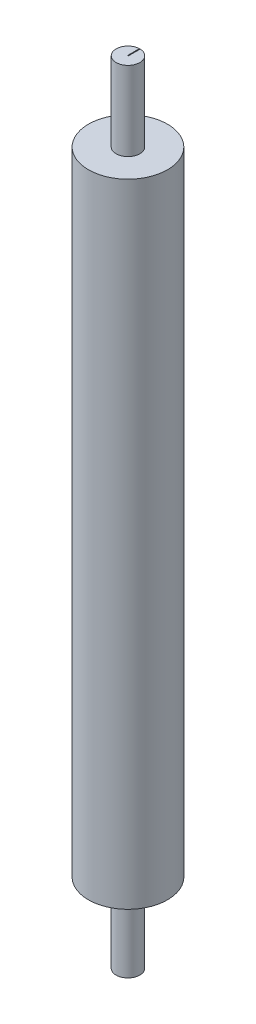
ISO-10303-21;
HEADER;
FILE_DESCRIPTION(('STEP AP214'),'2;1');
FILE_NAME('part.step','',(''),(''),'','','');
FILE_SCHEMA(('AUTOMOTIVE_DESIGN { 1 0 10303 214 1 1 1 1 }'));
ENDSEC;
DATA;
#1=APPLICATION_CONTEXT('core data for automotive mechanical design processes');
#2=APPLICATION_PROTOCOL_DEFINITION('international standard','automotive_design',2000,#1);
#3=PRODUCT_CONTEXT('',#1,'mechanical');
#4=PRODUCT('Part','Part','',(#3));
#5=PRODUCT_RELATED_PRODUCT_CATEGORY('part','',(#4));
#6=PRODUCT_DEFINITION_FORMATION('','',#4);
#7=PRODUCT_DEFINITION_CONTEXT('part definition',#1,'design');
#8=PRODUCT_DEFINITION('design','',#6,#7);
#9=PRODUCT_DEFINITION_SHAPE('','',#8);
#10=(LENGTH_UNIT() NAMED_UNIT(*) SI_UNIT(.MILLI.,.METRE.));
#11=(NAMED_UNIT(*) PLANE_ANGLE_UNIT() SI_UNIT($,.RADIAN.));
#12=(NAMED_UNIT(*) SI_UNIT($,.STERADIAN.) SOLID_ANGLE_UNIT());
#13=UNCERTAINTY_MEASURE_WITH_UNIT(LENGTH_MEASURE(1.E-05),#10,'distance_accuracy_value','');
#14=(GEOMETRIC_REPRESENTATION_CONTEXT(3) GLOBAL_UNCERTAINTY_ASSIGNED_CONTEXT((#13)) GLOBAL_UNIT_ASSIGNED_CONTEXT((#10,
#11,#12)) REPRESENTATION_CONTEXT('',''));
#15=CARTESIAN_POINT('',(0.,0.,0.));
#16=DIRECTION('',(0.,0.,1.));
#17=DIRECTION('',(1.,0.,0.));
#18=AXIS2_PLACEMENT_3D('',#15,#16,#17);
#19=CARTESIAN_POINT('',(0.,400.,0.));
#20=DIRECTION('',(0.,-1.,0.));
#21=DIRECTION('',(0.,0.,-1.));
#22=AXIS2_PLACEMENT_3D('',#19,#20,#21);
#23=CYLINDRICAL_SURFACE('',#22,25.);
#24=CARTESIAN_POINT('',(0.,400.,0.));
#25=DIRECTION('',(0.,1.,0.));
#26=DIRECTION('',(0.,0.,1.));
#27=AXIS2_PLACEMENT_3D('',#24,#25,#26);
#28=CIRCLE('',#27,25.);
#29=CARTESIAN_POINT('',(0.,400.,25.));
#30=VERTEX_POINT('',#29);
#31=EDGE_CURVE('E111',#30,#30,#28,.T.);
#32=ORIENTED_EDGE('',*,*,#31,.F.);
#33=EDGE_LOOP('',(#32));
#34=FACE_BOUND('',#33,.T.);
#35=CARTESIAN_POINT('',(0.,0.,0.));
#36=DIRECTION('',(0.,1.,0.));
#37=DIRECTION('',(0.,0.,1.));
#38=AXIS2_PLACEMENT_3D('',#35,#36,#37);
#39=CIRCLE('',#38,25.);
#40=CARTESIAN_POINT('',(0.,0.,25.));
#41=VERTEX_POINT('',#40);
#42=EDGE_CURVE('E117',#41,#41,#39,.T.);
#43=ORIENTED_EDGE('',*,*,#42,.T.);
#44=EDGE_LOOP('',(#43));
#45=FACE_BOUND('',#44,.T.);
#46=ADVANCED_FACE('F36',(#34,#45),#23,.T.);
#47=CARTESIAN_POINT('',(0.,400.,0.));
#48=DIRECTION('',(0.,1.,0.));
#49=DIRECTION('',(0.,0.,1.));
#50=AXIS2_PLACEMENT_3D('',#47,#48,#49);
#51=PLANE('',#50);
#52=CARTESIAN_POINT('',(0.,400.,0.));
#53=DIRECTION('',(0.,1.,0.));
#54=DIRECTION('',(0.,0.,1.));
#55=AXIS2_PLACEMENT_3D('',#52,#53,#54);
#56=CIRCLE('',#55,7.5);
#57=CARTESIAN_POINT('',(0.,400.,7.5));
#58=VERTEX_POINT('',#57);
#59=EDGE_CURVE('E43',#58,#58,#56,.T.);
#60=ORIENTED_EDGE('',*,*,#59,.F.);
#61=EDGE_LOOP('',(#60));
#62=FACE_BOUND('',#61,.T.);
#63=ORIENTED_EDGE('',*,*,#31,.T.);
#64=EDGE_LOOP('',(#63));
#65=FACE_BOUND('',#64,.T.);
#66=ADVANCED_FACE('F126',(#62,#65),#51,.T.);
#67=CARTESIAN_POINT('',(0.,0.,0.));
#68=DIRECTION('',(0.,1.,0.));
#69=DIRECTION('',(0.,0.,1.));
#70=AXIS2_PLACEMENT_3D('',#67,#68,#69);
#71=PLANE('',#70);
#72=CARTESIAN_POINT('',(0.,0.,0.));
#73=DIRECTION('',(0.,1.,0.));
#74=DIRECTION('',(0.,0.,1.));
#75=AXIS2_PLACEMENT_3D('',#72,#73,#74);
#76=CIRCLE('',#75,7.5);
#77=CARTESIAN_POINT('',(0.,0.,7.5));
#78=VERTEX_POINT('',#77);
#79=EDGE_CURVE('E114',#78,#78,#76,.T.);
#80=ORIENTED_EDGE('',*,*,#79,.T.);
#81=EDGE_LOOP('',(#80));
#82=FACE_BOUND('',#81,.T.);
#83=ORIENTED_EDGE('',*,*,#42,.F.);
#84=EDGE_LOOP('',(#83));
#85=FACE_BOUND('',#84,.T.);
#86=ADVANCED_FACE('F123',(#82,#85),#71,.F.);
#87=CARTESIAN_POINT('',(0.,-40.,0.));
#88=DIRECTION('',(0.,1.,0.));
#89=DIRECTION('',(0.,0.,1.));
#90=AXIS2_PLACEMENT_3D('',#87,#88,#89);
#91=CYLINDRICAL_SURFACE('',#90,7.5);
#92=ORIENTED_EDGE('',*,*,#79,.F.);
#93=EDGE_LOOP('',(#92));
#94=FACE_BOUND('',#93,.T.);
#95=CARTESIAN_POINT('',(0.,-50.,0.));
#96=DIRECTION('',(0.,1.,0.));
#97=DIRECTION('',(0.,0.,1.));
#98=AXIS2_PLACEMENT_3D('',#95,#96,#97);
#99=CIRCLE('',#98,7.5);
#100=CARTESIAN_POINT('',(0.,-50.,7.5));
#101=VERTEX_POINT('',#100);
#102=EDGE_CURVE('E108',#101,#101,#99,.T.);
#103=ORIENTED_EDGE('',*,*,#102,.T.);
#104=EDGE_LOOP('',(#103));
#105=FACE_BOUND('',#104,.T.);
#106=ADVANCED_FACE('F125',(#94,#105),#91,.T.);
#107=CARTESIAN_POINT('',(0.,-50.,0.));
#108=DIRECTION('',(0.,1.,0.));
#109=DIRECTION('',(0.,0.,1.));
#110=AXIS2_PLACEMENT_3D('',#107,#108,#109);
#111=PLANE('',#110);
#112=ORIENTED_EDGE('',*,*,#102,.F.);
#113=EDGE_LOOP('',(#112));
#114=FACE_BOUND('',#113,.T.);
#115=ADVANCED_FACE('F132',(#114),#111,.F.);
#116=CARTESIAN_POINT('',(0.,450.,0.));
#117=DIRECTION('',(0.,-1.,0.));
#118=DIRECTION('',(0.,0.,-1.));
#119=AXIS2_PLACEMENT_3D('',#116,#117,#118);
#120=CYLINDRICAL_SURFACE('',#119,7.5);
#121=CARTESIAN_POINT('',(0.,449.5,0.));
#122=DIRECTION('',(0.,-1.,0.));
#123=DIRECTION('',(0.,0.,-1.));
#124=AXIS2_PLACEMENT_3D('',#121,#122,#123);
#125=CIRCLE('',#124,7.5);
#126=CARTESIAN_POINT('',(-0.25,449.5,-7.49583217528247));
#127=VERTEX_POINT('',#126);
#128=CARTESIAN_POINT('',(0.25,449.5,-7.49583217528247));
#129=VERTEX_POINT('',#128);
#130=EDGE_CURVE('E11',#127,#129,#125,.T.);
#131=ORIENTED_EDGE('',*,*,#130,.T.);
#132=DIRECTION('',(0.,-1.,0.));
#133=VECTOR('',#132,1.);
#134=CARTESIAN_POINT('',(0.25,450.,-7.49583217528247));
#135=LINE('',#134,#133);
#136=CARTESIAN_POINT('',(0.25,450.,-7.49583217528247));
#137=VERTEX_POINT('',#136);
#138=EDGE_CURVE('E103',#129,#137,#135,.F.);
#139=ORIENTED_EDGE('',*,*,#138,.T.);
#140=CARTESIAN_POINT('',(0.,450.,0.));
#141=DIRECTION('',(0.,1.,0.));
#142=DIRECTION('',(0.,0.,1.));
#143=AXIS2_PLACEMENT_3D('',#140,#141,#142);
#144=CIRCLE('',#143,7.5);
#145=CARTESIAN_POINT('',(-0.25,450.,-7.49583217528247));
#146=VERTEX_POINT('',#145);
#147=EDGE_CURVE('E105',#146,#137,#144,.T.);
#148=ORIENTED_EDGE('',*,*,#147,.F.);
#149=DIRECTION('',(0.,-1.,0.));
#150=VECTOR('',#149,1.);
#151=CARTESIAN_POINT('',(-0.25,450.,-7.49583217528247));
#152=LINE('',#151,#150);
#153=EDGE_CURVE('E50',#127,#146,#152,.F.);
#154=ORIENTED_EDGE('',*,*,#153,.F.);
#155=EDGE_LOOP('',(#131,#139,#148,#154));
#156=FACE_BOUND('',#155,.T.);
#157=ORIENTED_EDGE('',*,*,#59,.T.);
#158=EDGE_LOOP('',(#157));
#159=FACE_BOUND('',#158,.T.);
#160=ADVANCED_FACE('F163',(#156,#159),#120,.T.);
#161=CARTESIAN_POINT('',(0.,450.,0.));
#162=DIRECTION('',(0.,1.,0.));
#163=DIRECTION('',(0.,0.,1.));
#164=AXIS2_PLACEMENT_3D('',#161,#162,#163);
#165=PLANE('',#164);
#166=DIRECTION('',(0.,0.,-1.));
#167=VECTOR('',#166,1.);
#168=CARTESIAN_POINT('',(0.25,450.,0.));
#169=LINE('',#168,#167);
#170=CARTESIAN_POINT('',(0.25,450.,0.));
#171=VERTEX_POINT('',#170);
#172=EDGE_CURVE('E97',#171,#137,#169,.T.);
#173=ORIENTED_EDGE('',*,*,#172,.F.);
#174=DIRECTION('',(-1.,0.,0.));
#175=VECTOR('',#174,1.);
#176=CARTESIAN_POINT('',(0.25,450.,0.));
#177=LINE('',#176,#175);
#178=CARTESIAN_POINT('',(-0.25,450.,0.));
#179=VERTEX_POINT('',#178);
#180=EDGE_CURVE('E94',#171,#179,#177,.T.);
#181=ORIENTED_EDGE('',*,*,#180,.T.);
#182=DIRECTION('',(0.,0.,-1.));
#183=VECTOR('',#182,1.);
#184=CARTESIAN_POINT('',(-0.25,450.,0.));
#185=LINE('',#184,#183);
#186=EDGE_CURVE('E88',#179,#146,#185,.T.);
#187=ORIENTED_EDGE('',*,*,#186,.T.);
#188=ORIENTED_EDGE('',*,*,#147,.T.);
#189=EDGE_LOOP('',(#173,#181,#187,#188));
#190=FACE_BOUND('',#189,.T.);
#191=ADVANCED_FACE('F170',(#190),#165,.T.);
#192=CARTESIAN_POINT('',(0.,449.5,0.));
#193=DIRECTION('',(0.,-1.,0.));
#194=DIRECTION('',(-1.,0.,0.));
#195=AXIS2_PLACEMENT_3D('',#192,#193,#194);
#196=PLANE('',#195);
#197=ORIENTED_EDGE('',*,*,#130,.F.);
#198=DIRECTION('',(0.,0.,-1.));
#199=VECTOR('',#198,1.);
#200=CARTESIAN_POINT('',(-0.25,449.5,0.));
#201=LINE('',#200,#199);
#202=CARTESIAN_POINT('',(-0.25,449.5,0.));
#203=VERTEX_POINT('',#202);
#204=EDGE_CURVE('E85',#203,#127,#201,.T.);
#205=ORIENTED_EDGE('',*,*,#204,.F.);
#206=DIRECTION('',(-1.,0.,0.));
#207=VECTOR('',#206,1.);
#208=CARTESIAN_POINT('',(0.25,449.5,0.));
#209=LINE('',#208,#207);
#210=CARTESIAN_POINT('',(0.25,449.5,0.));
#211=VERTEX_POINT('',#210);
#212=EDGE_CURVE('E75',#211,#203,#209,.T.);
#213=ORIENTED_EDGE('',*,*,#212,.F.);
#214=DIRECTION('',(0.,0.,-1.));
#215=VECTOR('',#214,1.);
#216=CARTESIAN_POINT('',(0.25,449.5,0.));
#217=LINE('',#216,#215);
#218=EDGE_CURVE('E92',#211,#129,#217,.T.);
#219=ORIENTED_EDGE('',*,*,#218,.T.);
#220=EDGE_LOOP('',(#197,#205,#213,#219));
#221=FACE_BOUND('',#220,.T.);
#222=ADVANCED_FACE('F91',(#221),#196,.F.);
#223=CARTESIAN_POINT('',(0.25,449.5,0.));
#224=DIRECTION('',(1.,0.,0.));
#225=DIRECTION('',(0.,0.,-1.));
#226=AXIS2_PLACEMENT_3D('',#223,#224,#225);
#227=PLANE('',#226);
#228=ORIENTED_EDGE('',*,*,#218,.F.);
#229=DIRECTION('',(0.,1.,0.));
#230=VECTOR('',#229,1.);
#231=CARTESIAN_POINT('',(0.25,449.5,0.));
#232=LINE('',#231,#230);
#233=EDGE_CURVE('E80',#211,#171,#232,.T.);
#234=ORIENTED_EDGE('',*,*,#233,.T.);
#235=ORIENTED_EDGE('',*,*,#172,.T.);
#236=ORIENTED_EDGE('',*,*,#138,.F.);
#237=EDGE_LOOP('',(#228,#234,#235,#236));
#238=FACE_BOUND('',#237,.T.);
#239=ADVANCED_FACE('F182',(#238),#227,.F.);
#240=CARTESIAN_POINT('',(-0.25,449.5,0.));
#241=DIRECTION('',(1.,0.,0.));
#242=DIRECTION('',(0.,0.,-1.));
#243=AXIS2_PLACEMENT_3D('',#240,#241,#242);
#244=PLANE('',#243);
#245=ORIENTED_EDGE('',*,*,#153,.T.);
#246=ORIENTED_EDGE('',*,*,#186,.F.);
#247=DIRECTION('',(0.,1.,0.));
#248=VECTOR('',#247,1.);
#249=CARTESIAN_POINT('',(-0.25,449.5,0.));
#250=LINE('',#249,#248);
#251=EDGE_CURVE('E79',#203,#179,#250,.T.);
#252=ORIENTED_EDGE('',*,*,#251,.F.);
#253=ORIENTED_EDGE('',*,*,#204,.T.);
#254=EDGE_LOOP('',(#245,#246,#252,#253));
#255=FACE_BOUND('',#254,.T.);
#256=ADVANCED_FACE('F87',(#255),#244,.T.);
#257=CARTESIAN_POINT('',(0.25,449.5,0.));
#258=DIRECTION('',(0.,0.,-1.));
#259=DIRECTION('',(-1.,0.,0.));
#260=AXIS2_PLACEMENT_3D('',#257,#258,#259);
#261=PLANE('',#260);
#262=ORIENTED_EDGE('',*,*,#180,.F.);
#263=ORIENTED_EDGE('',*,*,#233,.F.);
#264=ORIENTED_EDGE('',*,*,#212,.T.);
#265=ORIENTED_EDGE('',*,*,#251,.T.);
#266=EDGE_LOOP('',(#262,#263,#264,#265));
#267=FACE_BOUND('',#266,.T.);
#268=ADVANCED_FACE('F78',(#267),#261,.T.);
#269=CLOSED_SHELL('',(#46,#66,#86,#106,#115,#160,#191,#222,#239,#256,#268));
#270=MANIFOLD_SOLID_BREP('B2',#269);
#271=ADVANCED_BREP_SHAPE_REPRESENTATION('',(#18,#270),#14);
#272=SHAPE_DEFINITION_REPRESENTATION(#9,#271);
ENDSEC;
END-ISO-10303-21;
